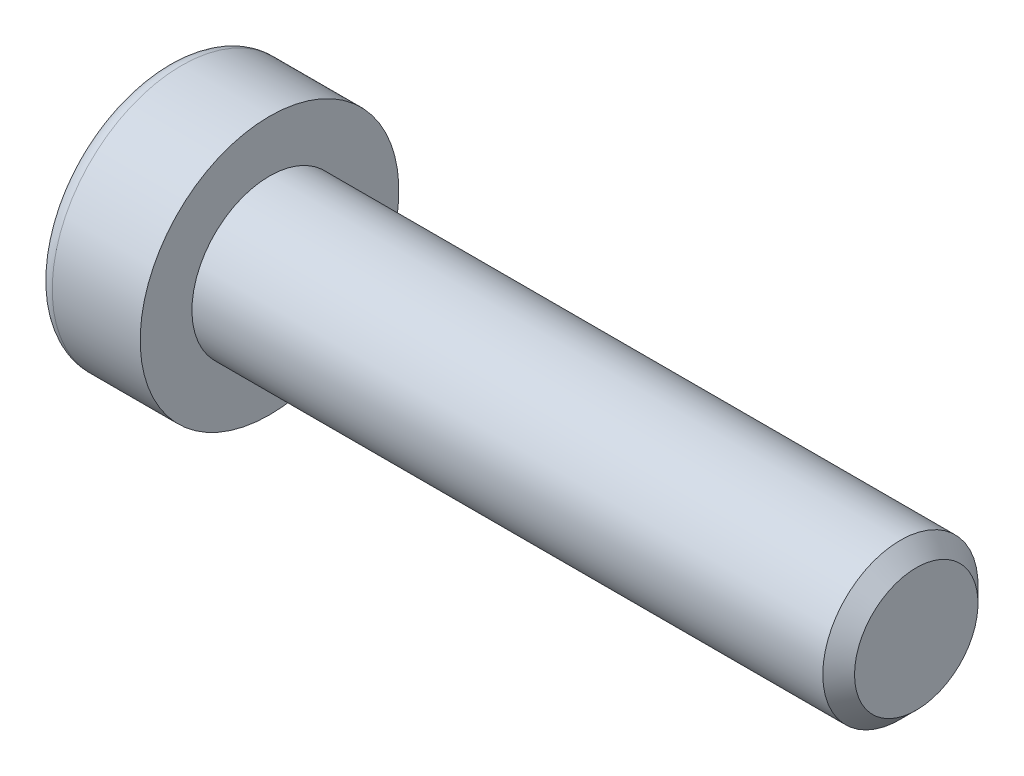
ISO-10303-21;
HEADER;
FILE_DESCRIPTION(('STEP AP214'),'2;1');
FILE_NAME('part.step','',(''),(''),'','','');
FILE_SCHEMA(('AUTOMOTIVE_DESIGN { 1 0 10303 214 1 1 1 1 }'));
ENDSEC;
DATA;
#1=APPLICATION_CONTEXT('core data for automotive mechanical design processes');
#2=APPLICATION_PROTOCOL_DEFINITION('international standard','automotive_design',2000,#1);
#3=PRODUCT_CONTEXT('',#1,'mechanical');
#4=PRODUCT('Part','Part','',(#3));
#5=PRODUCT_RELATED_PRODUCT_CATEGORY('part','',(#4));
#6=PRODUCT_DEFINITION_FORMATION('','',#4);
#7=PRODUCT_DEFINITION_CONTEXT('part definition',#1,'design');
#8=PRODUCT_DEFINITION('design','',#6,#7);
#9=PRODUCT_DEFINITION_SHAPE('','',#8);
#10=(LENGTH_UNIT() NAMED_UNIT(*) SI_UNIT(.MILLI.,.METRE.));
#11=(NAMED_UNIT(*) PLANE_ANGLE_UNIT() SI_UNIT($,.RADIAN.));
#12=(NAMED_UNIT(*) SI_UNIT($,.STERADIAN.) SOLID_ANGLE_UNIT());
#13=UNCERTAINTY_MEASURE_WITH_UNIT(LENGTH_MEASURE(1.E-05),#10,'distance_accuracy_value','');
#14=(GEOMETRIC_REPRESENTATION_CONTEXT(3) GLOBAL_UNCERTAINTY_ASSIGNED_CONTEXT((#13)) GLOBAL_UNIT_ASSIGNED_CONTEXT((#10,
#11,#12)) REPRESENTATION_CONTEXT('',''));
#15=CARTESIAN_POINT('',(0.,0.,0.));
#16=DIRECTION('',(0.,0.,1.));
#17=DIRECTION('',(1.,0.,0.));
#18=AXIS2_PLACEMENT_3D('',#15,#16,#17);
#19=CARTESIAN_POINT('',(-1.00800000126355,0.,0.));
#20=DIRECTION('',(-1.,0.,0.));
#21=DIRECTION('',(0.,0.,1.));
#22=AXIS2_PLACEMENT_3D('',#19,#20,#21);
#23=CONICAL_SURFACE('',#22,2.32325748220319,1.04719754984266);
#24=CARTESIAN_POINT('',(0.333333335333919,-2.27373675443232E-10,0.));
#25=VERTEX_POINT('',#24);
#26=VERTEX_LOOP('',#25);
#27=FACE_BOUND('',#26,.T.);
#28=CARTESIAN_POINT('',(-1.00000000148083,2.00000000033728,1.15470053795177));
#29=CARTESIAN_POINT('',(-0.970695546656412,2.00000000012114,1.05321634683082));
#30=CARTESIAN_POINT('',(-0.944044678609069,2.00000000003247,0.950856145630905));
#31=CARTESIAN_POINT('',(-0.897526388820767,1.99999999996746,0.744363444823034));
#32=CARTESIAN_POINT('',(-0.877675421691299,1.99999999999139,0.640227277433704));
#33=CARTESIAN_POINT('',(-0.84677596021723,2.0000000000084,0.433245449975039));
#34=CARTESIAN_POINT('',(-0.835521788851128,2.00000000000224,0.330431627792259));
#35=CARTESIAN_POINT('',(-0.822089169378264,1.99999999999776,0.124320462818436));
#36=CARTESIAN_POINT('',(-0.819899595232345,1.99999999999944,0.021023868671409));
#37=CARTESIAN_POINT('',(-0.824466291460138,2.00000000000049,-0.17197473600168));
#38=CARTESIAN_POINT('',(-0.830101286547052,2.00000000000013,-0.261705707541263));
#39=CARTESIAN_POINT('',(-0.847957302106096,1.99999999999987,-0.440583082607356));
#40=CARTESIAN_POINT('',(-0.86018441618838,1.99999999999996,-0.529728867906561));
#41=CARTESIAN_POINT('',(-0.890749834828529,2.00000000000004,-0.708974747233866));
#42=CARTESIAN_POINT('',(-0.909217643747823,2.00000000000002,-0.799052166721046));
#43=CARTESIAN_POINT('',(-0.95113176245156,1.99999999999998,-0.977863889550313));
#44=CARTESIAN_POINT('',(-0.974568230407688,1.99999999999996,-1.06660048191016));
#45=CARTESIAN_POINT('',(-1.00000000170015,2.,-1.15470053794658));
#46=B_SPLINE_CURVE_WITH_KNOTS('',3,(#28,#29,#30,#31,#32,#33,#34,#35,#36,#37,#38,#39,#40,#41,#42,
#43,#44,#45),.UNSPECIFIED.,.F.,.F.,(4,2,2,2,2,2,2,2,4),(0.,0.317016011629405,0.634793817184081,
0.944707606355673,1.25424088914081,1.52370778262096,1.79342419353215,2.06912162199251,
2.34427797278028),.UNSPECIFIED.);
#47=CARTESIAN_POINT('',(-1.00000000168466,1.99999999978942,1.15470053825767));
#48=VERTEX_POINT('',#47);
#49=CARTESIAN_POINT('',(-1.00000000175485,2.,-1.15470053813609));
#50=VERTEX_POINT('',#49);
#51=EDGE_CURVE('E20',#48,#50,#46,.T.);
#52=ORIENTED_EDGE('',*,*,#51,.T.);
#53=CARTESIAN_POINT('',(-1.00000000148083,1.99999999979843,-1.15470053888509));
#54=CARTESIAN_POINT('',(-0.970695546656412,1.91211211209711,-1.20544263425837));
#55=CARTESIAN_POINT('',(-0.944044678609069,1.82346557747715,-1.25662273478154));
#56=CARTESIAN_POINT('',(-0.897526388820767,1.64463765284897,-1.35986908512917));
#57=CARTESIAN_POINT('',(-0.877675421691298,1.55445308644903,-1.41193716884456));
#58=CARTESIAN_POINT('',(-0.846775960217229,1.37520156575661,-1.51542808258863));
#59=CARTESIAN_POINT('',(-0.835521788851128,1.28616218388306,-1.56683499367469));
#60=CARTESIAN_POINT('',(-0.822089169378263,1.10766467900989,-1.66989057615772));
#61=CARTESIAN_POINT('',(-0.819899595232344,1.01820720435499,-1.72153887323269));
#62=CARTESIAN_POINT('',(-0.824466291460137,0.851065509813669,-1.81803817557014));
#63=CARTESIAN_POINT('',(-0.830101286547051,0.773356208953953,-1.86290366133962));
#64=CARTESIAN_POINT('',(-0.847957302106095,0.618443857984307,-1.95234234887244));
#65=CARTESIAN_POINT('',(-0.860184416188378,0.541241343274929,-1.99691524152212));
#66=CARTESIAN_POINT('',(-0.890749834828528,0.38600985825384,-2.08653818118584));
#67=CARTESIAN_POINT('',(-0.909217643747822,0.308000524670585,-2.13157689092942));
#68=CARTESIAN_POINT('',(-0.951131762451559,0.153145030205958,-2.22098275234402));
#69=CARTESIAN_POINT('',(-0.974568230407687,0.0762968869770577,-2.26535104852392));
#70=CARTESIAN_POINT('',(-1.00000000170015,3.74707656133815E-10,-2.30940107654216));
#71=B_SPLINE_CURVE_WITH_KNOTS('',3,(#53,#54,#55,#56,#57,#58,#59,#60,#61,#62,#63,#64,#65,#66,#67,
#68,#69,#70),.UNSPECIFIED.,.F.,.F.,(4,2,2,2,2,2,2,2,4),(0.,0.317016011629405,0.63479381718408,
0.944707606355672,1.25424088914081,1.52370778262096,1.79342419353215,2.06912162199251,
2.34427797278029),.UNSPECIFIED.);
#72=CARTESIAN_POINT('',(-1.00000000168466,0.,-2.30940107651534));
#73=VERTEX_POINT('',#72);
#74=EDGE_CURVE('E80',#50,#73,#71,.T.);
#75=ORIENTED_EDGE('',*,*,#74,.T.);
#76=CARTESIAN_POINT('',(-1.00000000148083,-5.38851016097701E-10,-2.30940107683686));
#77=CARTESIAN_POINT('',(-0.970695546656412,-0.0878878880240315,-2.2586589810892));
#78=CARTESIAN_POINT('',(-0.944044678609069,-0.176534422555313,-2.20747888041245));
#79=CARTESIAN_POINT('',(-0.897526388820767,-0.355362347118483,-2.10423252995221));
#80=CARTESIAN_POINT('',(-0.877675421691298,-0.445546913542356,-2.05216444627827));
#81=CARTESIAN_POINT('',(-0.846775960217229,-0.624798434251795,-1.94867353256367));
#82=CARTESIAN_POINT('',(-0.835521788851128,-0.713837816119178,-1.89726662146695));
#83=CARTESIAN_POINT('',(-0.822089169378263,-0.892335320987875,-1.79421103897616));
#84=CARTESIAN_POINT('',(-0.819899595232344,-0.98179279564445,-1.7425627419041));
#85=CARTESIAN_POINT('',(-0.824466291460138,-1.14893449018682,-1.64606343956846));
#86=CARTESIAN_POINT('',(-0.830101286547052,-1.22664379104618,-1.60119795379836));
#87=CARTESIAN_POINT('',(-0.847957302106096,-1.38155614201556,-1.51175926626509));
#88=CARTESIAN_POINT('',(-0.860184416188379,-1.45875865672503,-1.46718637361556));
#89=CARTESIAN_POINT('',(-0.890749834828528,-1.6139901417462,-1.37756343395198));
#90=CARTESIAN_POINT('',(-0.909217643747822,-1.69199947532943,-1.33252472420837));
#91=CARTESIAN_POINT('',(-0.951131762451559,-1.84685496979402,-1.2431188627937));
#92=CARTESIAN_POINT('',(-0.974568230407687,-1.9237031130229,-1.19875056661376));
#93=CARTESIAN_POINT('',(-1.00000000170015,-1.99999999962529,-1.15470053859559));
#94=B_SPLINE_CURVE_WITH_KNOTS('',3,(#76,#77,#78,#79,#80,#81,#82,#83,#84,#85,#86,#87,#88,#89,#90,
#91,#92,#93),.UNSPECIFIED.,.F.,.F.,(4,2,2,2,2,2,2,2,4),(0.,0.317016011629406,0.634793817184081,
0.944707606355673,1.25424088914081,1.52370778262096,1.79342419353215,2.06912162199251,
2.34427797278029),.UNSPECIFIED.);
#95=CARTESIAN_POINT('',(-1.00000000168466,-1.99999999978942,-1.15470053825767));
#96=VERTEX_POINT('',#95);
#97=EDGE_CURVE('E105',#73,#96,#94,.T.);
#98=ORIENTED_EDGE('',*,*,#97,.T.);
#99=CARTESIAN_POINT('',(-1.00000000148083,-2.00000000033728,-1.15470053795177));
#100=CARTESIAN_POINT('',(-0.970695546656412,-2.00000000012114,-1.05321634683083));
#101=CARTESIAN_POINT('',(-0.944044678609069,-2.00000000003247,-0.950856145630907));
#102=CARTESIAN_POINT('',(-0.897526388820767,-1.99999999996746,-0.744363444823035));
#103=CARTESIAN_POINT('',(-0.877675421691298,-1.99999999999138,-0.640227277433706));
#104=CARTESIAN_POINT('',(-0.846775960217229,-2.0000000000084,-0.433245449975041));
#105=CARTESIAN_POINT('',(-0.835521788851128,-2.00000000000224,-0.330431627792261));
#106=CARTESIAN_POINT('',(-0.822089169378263,-1.99999999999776,-0.124320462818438));
#107=CARTESIAN_POINT('',(-0.819899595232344,-1.99999999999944,-0.0210238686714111));
#108=CARTESIAN_POINT('',(-0.824466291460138,-2.00000000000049,0.171974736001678));
#109=CARTESIAN_POINT('',(-0.830101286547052,-2.00000000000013,0.261705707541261));
#110=CARTESIAN_POINT('',(-0.847957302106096,-1.99999999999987,0.440583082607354));
#111=CARTESIAN_POINT('',(-0.860184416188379,-1.99999999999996,0.52972886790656));
#112=CARTESIAN_POINT('',(-0.890749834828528,-2.00000000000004,0.708974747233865));
#113=CARTESIAN_POINT('',(-0.909217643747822,-2.00000000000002,0.799052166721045));
#114=CARTESIAN_POINT('',(-0.951131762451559,-1.99999999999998,0.977863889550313));
#115=CARTESIAN_POINT('',(-0.974568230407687,-1.99999999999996,1.06660048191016));
#116=CARTESIAN_POINT('',(-1.00000000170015,-2.,1.15470053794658));
#117=B_SPLINE_CURVE_WITH_KNOTS('',3,(#99,#100,#101,#102,#103,#104,#105,#106,#107,#108,#109,#110,
#111,#112,#113,#114,#115,#116),.UNSPECIFIED.,.F.,.F.,(4,2,2,2,2,2,2,2,4),(0.,0.317016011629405,
0.63479381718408,0.944707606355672,1.25424088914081,1.52370778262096,1.79342419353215,
2.06912162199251,2.34427797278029),.UNSPECIFIED.);
#118=CARTESIAN_POINT('',(-1.00000000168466,-1.99999999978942,1.15470053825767));
#119=VERTEX_POINT('',#118);
#120=EDGE_CURVE('E129',#96,#119,#117,.T.);
#121=ORIENTED_EDGE('',*,*,#120,.T.);
#122=CARTESIAN_POINT('',(-1.00000000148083,-1.99999999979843,1.15470053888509));
#123=CARTESIAN_POINT('',(-0.970695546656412,-1.91211211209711,1.20544263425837));
#124=CARTESIAN_POINT('',(-0.944044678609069,-1.82346557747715,1.25662273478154));
#125=CARTESIAN_POINT('',(-0.897526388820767,-1.64463765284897,1.35986908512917));
#126=CARTESIAN_POINT('',(-0.877675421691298,-1.55445308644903,1.41193716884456));
#127=CARTESIAN_POINT('',(-0.846775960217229,-1.37520156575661,1.51542808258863));
#128=CARTESIAN_POINT('',(-0.835521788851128,-1.28616218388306,1.56683499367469));
#129=CARTESIAN_POINT('',(-0.822089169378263,-1.10766467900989,1.66989057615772));
#130=CARTESIAN_POINT('',(-0.819899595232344,-1.01820720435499,1.72153887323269));
#131=CARTESIAN_POINT('',(-0.824466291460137,-0.85106550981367,1.81803817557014));
#132=CARTESIAN_POINT('',(-0.830101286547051,-0.773356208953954,1.86290366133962));
#133=CARTESIAN_POINT('',(-0.847957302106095,-0.618443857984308,1.95234234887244));
#134=CARTESIAN_POINT('',(-0.860184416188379,-0.54124134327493,1.99691524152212));
#135=CARTESIAN_POINT('',(-0.890749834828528,-0.386009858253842,2.08653818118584));
#136=CARTESIAN_POINT('',(-0.909217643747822,-0.308000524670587,2.13157689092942));
#137=CARTESIAN_POINT('',(-0.951131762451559,-0.15314503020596,2.22098275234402));
#138=CARTESIAN_POINT('',(-0.974568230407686,-0.0762968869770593,2.26535104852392));
#139=CARTESIAN_POINT('',(-1.00000000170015,-3.74709270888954E-10,2.30940107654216));
#140=B_SPLINE_CURVE_WITH_KNOTS('',3,(#122,#123,#124,#125,#126,#127,#128,#129,#130,#131,#132,
#133,#134,#135,#136,#137,#138,#139),.UNSPECIFIED.,.F.,.F.,(4,2,2,2,2,2,2,2,4),(0.,
0.317016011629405,0.63479381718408,0.944707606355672,1.25424088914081,1.52370778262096,
1.79342419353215,2.06912162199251,2.34427797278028),.UNSPECIFIED.);
#141=CARTESIAN_POINT('',(-1.00000000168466,0.,2.30940107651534));
#142=VERTEX_POINT('',#141);
#143=EDGE_CURVE('E137',#119,#142,#140,.T.);
#144=ORIENTED_EDGE('',*,*,#143,.T.);
#145=CARTESIAN_POINT('',(-1.00000000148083,5.38850869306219E-10,2.30940107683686));
#146=CARTESIAN_POINT('',(-0.970695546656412,0.0878878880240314,2.2586589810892));
#147=CARTESIAN_POINT('',(-0.944044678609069,0.176534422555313,2.20747888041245));
#148=CARTESIAN_POINT('',(-0.897526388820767,0.355362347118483,2.10423252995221));
#149=CARTESIAN_POINT('',(-0.877675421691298,0.445546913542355,2.05216444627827));
#150=CARTESIAN_POINT('',(-0.846775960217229,0.624798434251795,1.94867353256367));
#151=CARTESIAN_POINT('',(-0.835521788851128,0.713837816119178,1.89726662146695));
#152=CARTESIAN_POINT('',(-0.822089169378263,0.892335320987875,1.79421103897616));
#153=CARTESIAN_POINT('',(-0.819899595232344,0.981792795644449,1.7425627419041));
#154=CARTESIAN_POINT('',(-0.824466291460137,1.14893449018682,1.64606343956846));
#155=CARTESIAN_POINT('',(-0.830101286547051,1.22664379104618,1.60119795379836));
#156=CARTESIAN_POINT('',(-0.847957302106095,1.38155614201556,1.51175926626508));
#157=CARTESIAN_POINT('',(-0.860184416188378,1.45875865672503,1.46718637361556));
#158=CARTESIAN_POINT('',(-0.890749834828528,1.6139901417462,1.37756343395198));
#159=CARTESIAN_POINT('',(-0.909217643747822,1.69199947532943,1.33252472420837));
#160=CARTESIAN_POINT('',(-0.951131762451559,1.84685496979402,1.2431188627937));
#161=CARTESIAN_POINT('',(-0.974568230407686,1.9237031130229,1.19875056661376));
#162=CARTESIAN_POINT('',(-1.00000000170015,1.99999999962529,1.15470053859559));
#163=B_SPLINE_CURVE_WITH_KNOTS('',3,(#145,#146,#147,#148,#149,#150,#151,#152,#153,#154,#155,
#156,#157,#158,#159,#160,#161,#162),.UNSPECIFIED.,.F.,.F.,(4,2,2,2,2,2,2,2,4),(0.,
0.317016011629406,0.63479381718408,0.944707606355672,1.25424088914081,1.52370778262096,
1.79342419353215,2.06912162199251,2.34427797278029),.UNSPECIFIED.);
#164=EDGE_CURVE('E82',#142,#48,#163,.T.);
#165=ORIENTED_EDGE('',*,*,#164,.T.);
#166=EDGE_LOOP('',(#52,#75,#98,#121,#144,#165));
#167=FACE_BOUND('',#166,.T.);
#168=ADVANCED_FACE('F16',(#27,#167),#23,.F.);
#169=CARTESIAN_POINT('',(-3.99999999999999,2.,1.15470053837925));
#170=DIRECTION('',(0.,1.,0.));
#171=DIRECTION('',(0.,0.,1.));
#172=AXIS2_PLACEMENT_3D('',#169,#170,#171);
#173=PLANE('',#172);
#174=DIRECTION('',(1.,0.,0.));
#175=VECTOR('',#174,1.);
#176=CARTESIAN_POINT('',(-3.99999999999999,2.,1.15470053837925));
#177=LINE('',#176,#175);
#178=CARTESIAN_POINT('',(-3.99999999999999,2.,1.15470053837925));
#179=VERTEX_POINT('',#178);
#180=EDGE_CURVE('E84',#48,#179,#177,.F.);
#181=ORIENTED_EDGE('',*,*,#180,.T.);
#182=DIRECTION('',(0.,0.,1.));
#183=VECTOR('',#182,1.);
#184=CARTESIAN_POINT('',(-3.99999999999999,2.,0.));
#185=LINE('',#184,#183);
#186=CARTESIAN_POINT('',(-3.99999999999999,2.,-1.15470053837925));
#187=VERTEX_POINT('',#186);
#188=EDGE_CURVE('E89',#187,#179,#185,.T.);
#189=ORIENTED_EDGE('',*,*,#188,.F.);
#190=DIRECTION('',(1.,0.,0.));
#191=VECTOR('',#190,1.);
#192=CARTESIAN_POINT('',(-3.99999999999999,2.,-1.15470053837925));
#193=LINE('',#192,#191);
#194=EDGE_CURVE('E87',#187,#50,#193,.T.);
#195=ORIENTED_EDGE('',*,*,#194,.T.);
#196=ORIENTED_EDGE('',*,*,#51,.F.);
#197=EDGE_LOOP('',(#181,#189,#195,#196));
#198=FACE_BOUND('',#197,.T.);
#199=ADVANCED_FACE('F76',(#198),#173,.F.);
#200=CARTESIAN_POINT('',(-3.99999999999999,0.,2.3094010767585));
#201=DIRECTION('',(0.,0.500000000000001,0.866025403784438));
#202=DIRECTION('',(0.,-0.866025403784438,0.500000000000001));
#203=AXIS2_PLACEMENT_3D('',#200,#201,#202);
#204=PLANE('',#203);
#205=DIRECTION('',(1.,0.,0.));
#206=VECTOR('',#205,1.);
#207=CARTESIAN_POINT('',(-3.99999999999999,0.,2.3094010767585));
#208=LINE('',#207,#206);
#209=CARTESIAN_POINT('',(-3.99999999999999,0.,2.3094010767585));
#210=VERTEX_POINT('',#209);
#211=EDGE_CURVE('E141',#142,#210,#208,.F.);
#212=ORIENTED_EDGE('',*,*,#211,.T.);
#213=DIRECTION('',(0.,-0.866025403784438,0.500000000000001));
#214=VECTOR('',#213,1.);
#215=CARTESIAN_POINT('',(-3.99999999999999,2.,1.15470053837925));
#216=LINE('',#215,#214);
#217=EDGE_CURVE('E95',#179,#210,#216,.T.);
#218=ORIENTED_EDGE('',*,*,#217,.F.);
#219=ORIENTED_EDGE('',*,*,#180,.F.);
#220=ORIENTED_EDGE('',*,*,#164,.F.);
#221=EDGE_LOOP('',(#212,#218,#219,#220));
#222=FACE_BOUND('',#221,.T.);
#223=ADVANCED_FACE('F145',(#222),#204,.F.);
#224=CARTESIAN_POINT('',(-3.99999999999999,-2.,1.15470053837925));
#225=DIRECTION('',(0.,-0.5,0.866025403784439));
#226=DIRECTION('',(0.,-0.866025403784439,-0.5));
#227=AXIS2_PLACEMENT_3D('',#224,#225,#226);
#228=PLANE('',#227);
#229=DIRECTION('',(1.,0.,0.));
#230=VECTOR('',#229,1.);
#231=CARTESIAN_POINT('',(-3.99999999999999,-2.,1.15470053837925));
#232=LINE('',#231,#230);
#233=CARTESIAN_POINT('',(-3.99999999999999,-2.,1.15470053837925));
#234=VERTEX_POINT('',#233);
#235=EDGE_CURVE('E136',#119,#234,#232,.F.);
#236=ORIENTED_EDGE('',*,*,#235,.T.);
#237=DIRECTION('',(0.,-0.866025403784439,-0.5));
#238=VECTOR('',#237,1.);
#239=CARTESIAN_POINT('',(-3.99999999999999,0.,2.3094010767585));
#240=LINE('',#239,#238);
#241=EDGE_CURVE('E223',#210,#234,#240,.T.);
#242=ORIENTED_EDGE('',*,*,#241,.F.);
#243=ORIENTED_EDGE('',*,*,#211,.F.);
#244=ORIENTED_EDGE('',*,*,#143,.F.);
#245=EDGE_LOOP('',(#236,#242,#243,#244));
#246=FACE_BOUND('',#245,.T.);
#247=ADVANCED_FACE('F125',(#246),#228,.F.);
#248=CARTESIAN_POINT('',(-3.99999999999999,-2.,-1.15470053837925));
#249=DIRECTION('',(0.,-1.,0.));
#250=DIRECTION('',(0.,0.,-1.));
#251=AXIS2_PLACEMENT_3D('',#248,#249,#250);
#252=PLANE('',#251);
#253=DIRECTION('',(1.,0.,0.));
#254=VECTOR('',#253,1.);
#255=CARTESIAN_POINT('',(-3.99999999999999,-2.,-1.15470053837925));
#256=LINE('',#255,#254);
#257=CARTESIAN_POINT('',(-3.99999999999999,-2.,-1.15470053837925));
#258=VERTEX_POINT('',#257);
#259=EDGE_CURVE('E135',#96,#258,#256,.F.);
#260=ORIENTED_EDGE('',*,*,#259,.T.);
#261=DIRECTION('',(0.,0.,1.));
#262=VECTOR('',#261,1.);
#263=CARTESIAN_POINT('',(-3.99999999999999,-2.,0.));
#264=LINE('',#263,#262);
#265=EDGE_CURVE('E220',#234,#258,#264,.F.);
#266=ORIENTED_EDGE('',*,*,#265,.F.);
#267=ORIENTED_EDGE('',*,*,#235,.F.);
#268=ORIENTED_EDGE('',*,*,#120,.F.);
#269=EDGE_LOOP('',(#260,#266,#267,#268));
#270=FACE_BOUND('',#269,.T.);
#271=ADVANCED_FACE('F121',(#270),#252,.F.);
#272=CARTESIAN_POINT('',(-3.99999999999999,0.,-2.3094010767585));
#273=DIRECTION('',(0.,-0.5,-0.866025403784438));
#274=DIRECTION('',(0.,0.866025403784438,-0.5));
#275=AXIS2_PLACEMENT_3D('',#272,#273,#274);
#276=PLANE('',#275);
#277=DIRECTION('',(1.,0.,0.));
#278=VECTOR('',#277,1.);
#279=CARTESIAN_POINT('',(-3.99999999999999,0.,-2.3094010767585));
#280=LINE('',#279,#278);
#281=CARTESIAN_POINT('',(-3.99999999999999,0.,-2.3094010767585));
#282=VERTEX_POINT('',#281);
#283=EDGE_CURVE('E38',#73,#282,#280,.F.);
#284=ORIENTED_EDGE('',*,*,#283,.T.);
#285=DIRECTION('',(0.,0.866025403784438,-0.5));
#286=VECTOR('',#285,1.);
#287=CARTESIAN_POINT('',(-3.99999999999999,-2.,-1.15470053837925));
#288=LINE('',#287,#286);
#289=EDGE_CURVE('E217',#258,#282,#288,.T.);
#290=ORIENTED_EDGE('',*,*,#289,.F.);
#291=ORIENTED_EDGE('',*,*,#259,.F.);
#292=ORIENTED_EDGE('',*,*,#97,.F.);
#293=EDGE_LOOP('',(#284,#290,#291,#292));
#294=FACE_BOUND('',#293,.T.);
#295=ADVANCED_FACE('F115',(#294),#276,.F.);
#296=CARTESIAN_POINT('',(-3.99999999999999,2.,-1.15470053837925));
#297=DIRECTION('',(0.,0.5,-0.866025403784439));
#298=DIRECTION('',(0.,0.866025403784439,0.5));
#299=AXIS2_PLACEMENT_3D('',#296,#297,#298);
#300=PLANE('',#299);
#301=ORIENTED_EDGE('',*,*,#194,.F.);
#302=DIRECTION('',(0.,0.866025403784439,0.5));
#303=VECTOR('',#302,1.);
#304=CARTESIAN_POINT('',(-3.99999999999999,0.,-2.3094010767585));
#305=LINE('',#304,#303);
#306=EDGE_CURVE('E215',#282,#187,#305,.T.);
#307=ORIENTED_EDGE('',*,*,#306,.F.);
#308=ORIENTED_EDGE('',*,*,#283,.F.);
#309=ORIENTED_EDGE('',*,*,#74,.F.);
#310=EDGE_LOOP('',(#301,#307,#308,#309));
#311=FACE_BOUND('',#310,.T.);
#312=ADVANCED_FACE('F93',(#311),#300,.F.);
#313=CARTESIAN_POINT('',(-3.99999999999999,3.65470053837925,0.));
#314=DIRECTION('',(-1.,0.,0.));
#315=DIRECTION('',(0.,0.,1.));
#316=AXIS2_PLACEMENT_3D('',#313,#314,#315);
#317=PLANE('',#316);
#318=ORIENTED_EDGE('',*,*,#289,.T.);
#319=ORIENTED_EDGE('',*,*,#306,.T.);
#320=ORIENTED_EDGE('',*,*,#188,.T.);
#321=ORIENTED_EDGE('',*,*,#217,.T.);
#322=ORIENTED_EDGE('',*,*,#241,.T.);
#323=ORIENTED_EDGE('',*,*,#265,.T.);
#324=EDGE_LOOP('',(#318,#319,#320,#321,#322,#323));
#325=FACE_BOUND('',#324,.T.);
#326=CARTESIAN_POINT('',(-3.99999999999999,0.,0.));
#327=DIRECTION('',(1.,0.,0.));
#328=DIRECTION('',(0.,1.,0.));
#329=AXIS2_PLACEMENT_3D('',#326,#327,#328);
#330=CIRCLE('',#329,4.4);
#331=CARTESIAN_POINT('',(-3.99999999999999,4.4,0.));
#332=VERTEX_POINT('',#331);
#333=EDGE_CURVE('E192',#332,#332,#330,.T.);
#334=ORIENTED_EDGE('',*,*,#333,.F.);
#335=EDGE_LOOP('',(#334));
#336=FACE_BOUND('',#335,.T.);
#337=ADVANCED_FACE('F114',(#325,#336),#317,.T.);
#338=CARTESIAN_POINT('',(-3.4,0.,0.));
#339=DIRECTION('',(1.,0.,0.));
#340=DIRECTION('',(0.,0.,-1.));
#341=AXIS2_PLACEMENT_3D('',#338,#339,#340);
#342=TOROIDAL_SURFACE('',#341,4.4,0.6);
#343=CARTESIAN_POINT('',(-3.4,0.,0.));
#344=DIRECTION('',(1.,0.,0.));
#345=DIRECTION('',(0.,1.,0.));
#346=AXIS2_PLACEMENT_3D('',#343,#344,#345);
#347=CIRCLE('',#346,5.);
#348=CARTESIAN_POINT('',(-3.4,5.,0.));
#349=VERTEX_POINT('',#348);
#350=EDGE_CURVE('E233',#349,#349,#347,.T.);
#351=ORIENTED_EDGE('',*,*,#350,.F.);
#352=EDGE_LOOP('',(#351));
#353=FACE_BOUND('',#352,.T.);
#354=ORIENTED_EDGE('',*,*,#333,.T.);
#355=EDGE_LOOP('',(#354));
#356=FACE_BOUND('',#355,.T.);
#357=ADVANCED_FACE('F176',(#353,#356),#342,.T.);
#358=CARTESIAN_POINT('',(-2.,0.,0.));
#359=DIRECTION('',(1.,0.,0.));
#360=DIRECTION('',(0.,1.,0.));
#361=AXIS2_PLACEMENT_3D('',#358,#359,#360);
#362=CYLINDRICAL_SURFACE('',#361,5.);
#363=ORIENTED_EDGE('',*,*,#350,.T.);
#364=EDGE_LOOP('',(#363));
#365=FACE_BOUND('',#364,.T.);
#366=CARTESIAN_POINT('',(0.,0.,0.));
#367=DIRECTION('',(1.,0.,0.));
#368=DIRECTION('',(0.,1.,0.));
#369=AXIS2_PLACEMENT_3D('',#366,#367,#368);
#370=CIRCLE('',#369,5.);
#371=CARTESIAN_POINT('',(0.,5.,0.));
#372=VERTEX_POINT('',#371);
#373=EDGE_CURVE('E103',#372,#372,#370,.T.);
#374=ORIENTED_EDGE('',*,*,#373,.F.);
#375=EDGE_LOOP('',(#374));
#376=FACE_BOUND('',#375,.T.);
#377=ADVANCED_FACE('F173',(#365,#376),#362,.T.);
#378=CARTESIAN_POINT('',(25.,1.5,0.));
#379=DIRECTION('',(1.,0.,0.));
#380=DIRECTION('',(0.,0.,-1.));
#381=AXIS2_PLACEMENT_3D('',#378,#379,#380);
#382=PLANE('',#381);
#383=CARTESIAN_POINT('',(25.0000000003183,0.,0.));
#384=DIRECTION('',(-1.,0.,0.));
#385=DIRECTION('',(0.,0.,1.));
#386=AXIS2_PLACEMENT_3D('',#383,#384,#385);
#387=CIRCLE('',#386,2.38655000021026);
#388=CARTESIAN_POINT('',(25.0000000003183,0.,2.38655000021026));
#389=VERTEX_POINT('',#388);
#390=EDGE_CURVE('E229',#389,#389,#387,.T.);
#391=ORIENTED_EDGE('',*,*,#390,.F.);
#392=EDGE_LOOP('',(#391));
#393=FACE_BOUND('',#392,.T.);
#394=ADVANCED_FACE('F169',(#393),#382,.T.);
#395=CARTESIAN_POINT('',(0.,4.,0.));
#396=DIRECTION('',(1.,0.,0.));
#397=DIRECTION('',(0.,0.,-1.));
#398=AXIS2_PLACEMENT_3D('',#395,#396,#397);
#399=PLANE('',#398);
#400=CARTESIAN_POINT('',(0.,0.,0.));
#401=DIRECTION('',(1.,0.,0.));
#402=DIRECTION('',(0.,1.,0.));
#403=AXIS2_PLACEMENT_3D('',#400,#401,#402);
#404=CIRCLE('',#403,3.);
#405=CARTESIAN_POINT('',(0.,3.,0.));
#406=VERTEX_POINT('',#405);
#407=EDGE_CURVE('E29',#406,#406,#404,.T.);
#408=ORIENTED_EDGE('',*,*,#407,.F.);
#409=EDGE_LOOP('',(#408));
#410=FACE_BOUND('',#409,.T.);
#411=ORIENTED_EDGE('',*,*,#373,.T.);
#412=EDGE_LOOP('',(#411));
#413=FACE_BOUND('',#412,.T.);
#414=ADVANCED_FACE('F162',(#410,#413),#399,.T.);
#415=CARTESIAN_POINT('',(24.3865499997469,0.,0.));
#416=DIRECTION('',(-1.,0.,0.));
#417=DIRECTION('',(0.,0.,1.));
#418=AXIS2_PLACEMENT_3D('',#415,#416,#417);
#419=CONICAL_SURFACE('',#418,2.99999999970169,0.785398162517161);
#420=ORIENTED_EDGE('',*,*,#390,.T.);
#421=EDGE_LOOP('',(#420));
#422=FACE_BOUND('',#421,.T.);
#423=CARTESIAN_POINT('',(24.38655,0.,0.));
#424=DIRECTION('',(1.,0.,0.));
#425=DIRECTION('',(0.,1.,0.));
#426=AXIS2_PLACEMENT_3D('',#423,#424,#425);
#427=CIRCLE('',#426,3.);
#428=CARTESIAN_POINT('',(24.38655,3.,0.));
#429=VERTEX_POINT('',#428);
#430=EDGE_CURVE('E11',#429,#429,#427,.F.);
#431=ORIENTED_EDGE('',*,*,#430,.F.);
#432=EDGE_LOOP('',(#431));
#433=FACE_BOUND('',#432,.T.);
#434=ADVANCED_FACE('F156',(#422,#433),#419,.T.);
#435=CARTESIAN_POINT('',(14.,0.,0.));
#436=DIRECTION('',(1.,0.,0.));
#437=DIRECTION('',(0.,1.,0.));
#438=AXIS2_PLACEMENT_3D('',#435,#436,#437);
#439=CYLINDRICAL_SURFACE('',#438,3.);
#440=ORIENTED_EDGE('',*,*,#430,.T.);
#441=EDGE_LOOP('',(#440));
#442=FACE_BOUND('',#441,.T.);
#443=ORIENTED_EDGE('',*,*,#407,.T.);
#444=EDGE_LOOP('',(#443));
#445=FACE_BOUND('',#444,.T.);
#446=ADVANCED_FACE('F154',(#442,#445),#439,.T.);
#447=CLOSED_SHELL('',(#168,#199,#223,#247,#271,#295,#312,#337,#357,#377,#394,#414,#434,#446));
#448=MANIFOLD_SOLID_BREP('B1',#447);
#449=ADVANCED_BREP_SHAPE_REPRESENTATION('',(#18,#448),#14);
#450=SHAPE_DEFINITION_REPRESENTATION(#9,#449);
ENDSEC;
END-ISO-10303-21;
